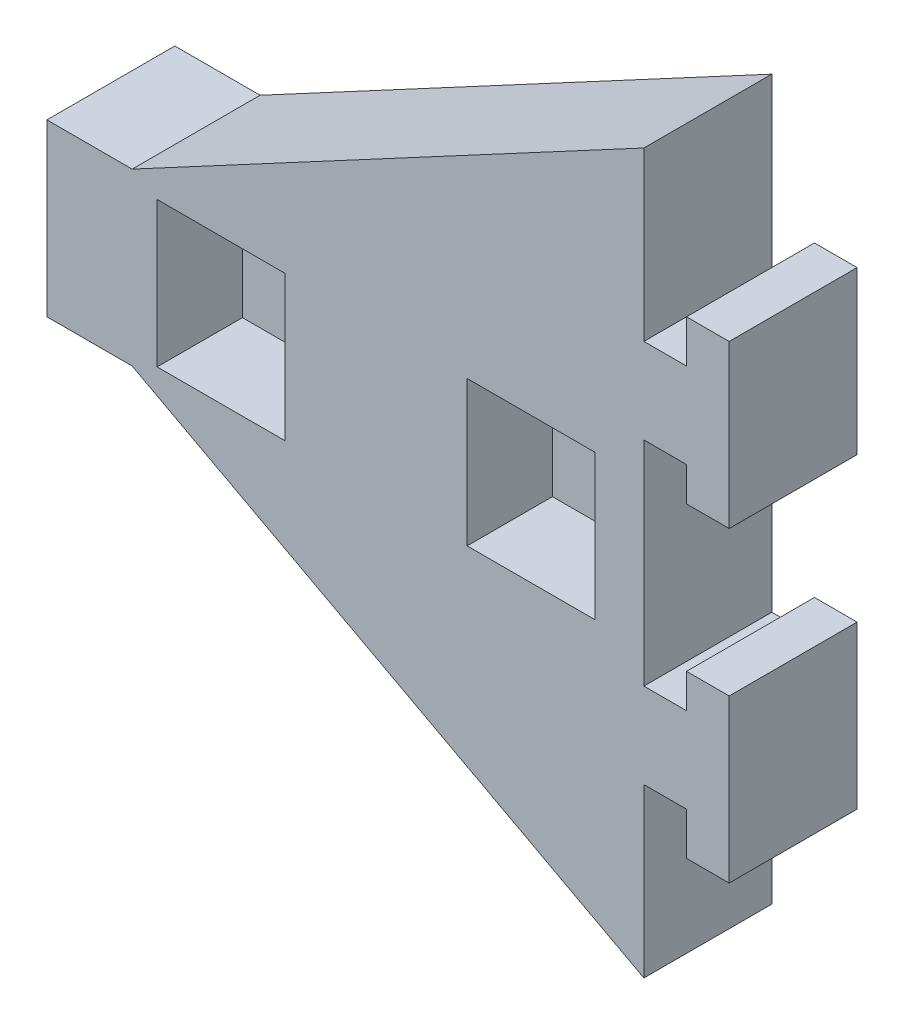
from build123d import *

# Parameters (mm, degrees)
BOSS_EXTRUDE4_DEPTH   = 15
CUT_EXTRUDE4_DEPTH    = 15
SKETCH7_W             = 15
SKETCH7_H             = 17
CUT_EXTRUDE5_DEPTH    = 10
CROQUIS1_W            = 5
CROQUIS1_H            = 1
CORTAR_EXTRUIR1_DEPTH = 15


with BuildPart() as part:
    # Sketch4 → Boss-Extrude4 (new body)
    with BuildSketch(Plane.XY):
        Polygon((70, 0), (70, -95), (0, -57.5), (-10, -57.5), (-10, -37.5), (0, -37.5), align=None)
    extrude(amount=BOSS_EXTRUDE4_DEPTH)

    # Sketch6 → Cut-Extrude4 (cut)
    with BuildSketch(Plane.XY.offset(15)):
        Polygon((65, -20), (70, -20), (70, 0), (60, -5.357142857), (60, -25), (65, -25), align=None)
        Polygon((60, -70), (60, -89.642857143), (70, -95), (70, -75), (65, -75), (65, -70), align=None)
        Polygon((65, -55), (70, -55), (70, -40), (65, -40), (65, -35), (60, -35), (60, -60), (65, -60), align=None)
    extrude(amount=-CUT_EXTRUDE4_DEPTH, mode=Mode.SUBTRACT)

    # Sketch7 → Cut-Extrude5 (cut)
    with BuildSketch(Plane.XY.offset(15)):
        with Locations((46.774648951, -47.623659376)):
            Rectangle(SKETCH7_W, SKETCH7_H)
        Polygon((2.924225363, -47.623659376), (2.924225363, -56.123659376), (17.924225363, -56.123659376), (17.924225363, -39.123659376), (2.924225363, -39.123659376), align=None)
    extrude(amount=-CUT_EXTRUDE5_DEPTH, mode=Mode.SUBTRACT)

    # Croquis1 → Cortar-Extruir1 (cut)
    with BuildSketch(Plane.XY.offset(15)):
        with Locations((67.5, -55.5)):
            Rectangle(CROQUIS1_W, CROQUIS1_H)
        with Locations((67.5, -39.5)):
            Rectangle(CROQUIS1_W, CROQUIS1_H)
    extrude(amount=-CORTAR_EXTRUIR1_DEPTH, mode=Mode.SUBTRACT)


solid = part.part
